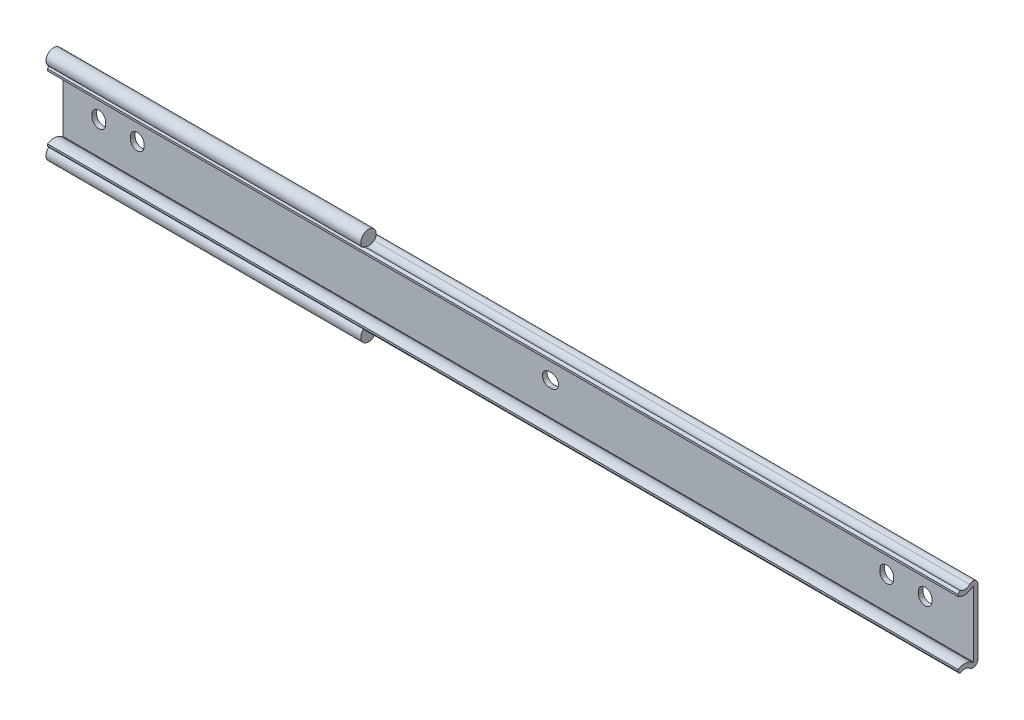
ISO-10303-21;
HEADER;
FILE_DESCRIPTION(('STEP AP214'),'2;1');
FILE_NAME('part.step','',(''),(''),'','','');
FILE_SCHEMA(('AUTOMOTIVE_DESIGN { 1 0 10303 214 1 1 1 1 }'));
ENDSEC;
DATA;
#1=APPLICATION_CONTEXT('core data for automotive mechanical design processes');
#2=APPLICATION_PROTOCOL_DEFINITION('international standard','automotive_design',2000,#1);
#3=PRODUCT_CONTEXT('',#1,'mechanical');
#4=PRODUCT('Part','Part','',(#3));
#5=PRODUCT_RELATED_PRODUCT_CATEGORY('part','',(#4));
#6=PRODUCT_DEFINITION_FORMATION('','',#4);
#7=PRODUCT_DEFINITION_CONTEXT('part definition',#1,'design');
#8=PRODUCT_DEFINITION('design','',#6,#7);
#9=PRODUCT_DEFINITION_SHAPE('','',#8);
#10=(LENGTH_UNIT() NAMED_UNIT(*) SI_UNIT(.MILLI.,.METRE.));
#11=(NAMED_UNIT(*) PLANE_ANGLE_UNIT() SI_UNIT($,.RADIAN.));
#12=(NAMED_UNIT(*) SI_UNIT($,.STERADIAN.) SOLID_ANGLE_UNIT());
#13=UNCERTAINTY_MEASURE_WITH_UNIT(LENGTH_MEASURE(1.E-05),#10,'distance_accuracy_value','');
#14=(GEOMETRIC_REPRESENTATION_CONTEXT(3) GLOBAL_UNCERTAINTY_ASSIGNED_CONTEXT((#13)) GLOBAL_UNIT_ASSIGNED_CONTEXT((#10,
#11,#12)) REPRESENTATION_CONTEXT('',''));
#15=CARTESIAN_POINT('',(0.,0.,0.));
#16=DIRECTION('',(0.,0.,1.));
#17=DIRECTION('',(1.,0.,0.));
#18=AXIS2_PLACEMENT_3D('',#15,#16,#17);
#19=CARTESIAN_POINT('',(-11.9,13.9150000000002,4.44999999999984));
#20=DIRECTION('',(1.,0.,0.));
#21=DIRECTION('',(0.,0.,-1.));
#22=AXIS2_PLACEMENT_3D('',#19,#20,#21);
#23=CYLINDRICAL_SURFACE('',#22,2.55000000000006);
#24=DIRECTION('',(1.,0.,0.));
#25=VECTOR('',#24,1.);
#26=CARTESIAN_POINT('',(-11.9,12.0059666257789,2.75941087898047));
#27=LINE('',#26,#25);
#28=CARTESIAN_POINT('',(92.1,12.0059666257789,2.75941087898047));
#29=VERTEX_POINT('',#28);
#30=CARTESIAN_POINT('',(288.9,12.0059666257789,2.75941087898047));
#31=VERTEX_POINT('',#30);
#32=EDGE_CURVE('E474',#29,#31,#27,.T.);
#33=ORIENTED_EDGE('',*,*,#32,.F.);
#34=CARTESIAN_POINT('',(92.1,13.9150000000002,4.44999999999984));
#35=DIRECTION('',(-1.,0.,0.));
#36=DIRECTION('',(0.,0.,1.));
#37=AXIS2_PLACEMENT_3D('',#34,#35,#36);
#38=CIRCLE('',#37,2.55000000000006);
#39=CARTESIAN_POINT('',(92.1,11.8784795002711,5.98462837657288));
#40=VERTEX_POINT('',#39);
#41=EDGE_CURVE('E287',#29,#40,#38,.T.);
#42=ORIENTED_EDGE('',*,*,#41,.T.);
#43=DIRECTION('',(1.,0.,0.));
#44=VECTOR('',#43,1.);
#45=CARTESIAN_POINT('',(-11.9,11.8784795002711,5.98462837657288));
#46=LINE('',#45,#44);
#47=CARTESIAN_POINT('',(288.9,11.8784795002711,5.98462837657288));
#48=VERTEX_POINT('',#47);
#49=EDGE_CURVE('E473',#40,#48,#46,.T.);
#50=ORIENTED_EDGE('',*,*,#49,.T.);
#51=CARTESIAN_POINT('',(288.9,13.9150000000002,4.44999999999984));
#52=DIRECTION('',(-1.,0.,0.));
#53=DIRECTION('',(0.,0.,1.));
#54=AXIS2_PLACEMENT_3D('',#51,#52,#53);
#55=CIRCLE('',#54,2.55000000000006);
#56=EDGE_CURVE('E401',#31,#48,#55,.T.);
#57=ORIENTED_EDGE('',*,*,#56,.F.);
#58=EDGE_LOOP('',(#33,#42,#50,#57));
#59=FACE_BOUND('',#58,.T.);
#60=ADVANCED_FACE('F16',(#59),#23,.F.);
#61=CARTESIAN_POINT('',(-11.9,-10.7622239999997,0.));
#62=DIRECTION('',(0.,0.,-1.));
#63=DIRECTION('',(-1.,0.,0.));
#64=AXIS2_PLACEMENT_3D('',#61,#62,#63);
#65=PLANE('',#64);
#66=DIRECTION('',(0.,1.,0.));
#67=VECTOR('',#66,1.);
#68=CARTESIAN_POINT('',(-11.9,-10.7622239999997,0.));
#69=LINE('',#68,#67);
#70=CARTESIAN_POINT('',(-11.9,-10.7622239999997,0.));
#71=VERTEX_POINT('',#70);
#72=CARTESIAN_POINT('',(-11.9,10.7622240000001,0.));
#73=VERTEX_POINT('',#72);
#74=EDGE_CURVE('E469',#71,#73,#69,.T.);
#75=ORIENTED_EDGE('',*,*,#74,.T.);
#76=DIRECTION('',(1.,0.,0.));
#77=VECTOR('',#76,1.);
#78=CARTESIAN_POINT('',(-11.9,10.7622240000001,0.));
#79=LINE('',#78,#77);
#80=CARTESIAN_POINT('',(288.9,10.7622240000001,0.));
#81=VERTEX_POINT('',#80);
#82=EDGE_CURVE('E477',#73,#81,#79,.T.);
#83=ORIENTED_EDGE('',*,*,#82,.T.);
#84=DIRECTION('',(0.,1.,0.));
#85=VECTOR('',#84,1.);
#86=CARTESIAN_POINT('',(288.9,-10.7622239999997,0.));
#87=LINE('',#86,#85);
#88=CARTESIAN_POINT('',(288.9,-10.7622239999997,0.));
#89=VERTEX_POINT('',#88);
#90=EDGE_CURVE('E441',#89,#81,#87,.T.);
#91=ORIENTED_EDGE('',*,*,#90,.F.);
#92=DIRECTION('',(1.,0.,0.));
#93=VECTOR('',#92,1.);
#94=CARTESIAN_POINT('',(-11.9,-10.7622239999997,0.));
#95=LINE('',#94,#93);
#96=EDGE_CURVE('E479',#71,#89,#95,.T.);
#97=ORIENTED_EDGE('',*,*,#96,.F.);
#98=EDGE_LOOP('',(#75,#83,#91,#97));
#99=FACE_BOUND('',#98,.T.);
#100=CARTESIAN_POINT('',(149.6,2.32452945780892E-13,0.));
#101=DIRECTION('',(0.,0.,-1.));
#102=DIRECTION('',(-1.,0.,0.));
#103=AXIS2_PLACEMENT_3D('',#100,#101,#102);
#104=CIRCLE('',#103,2.25);
#105=CARTESIAN_POINT('',(149.6,2.25000000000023,0.));
#106=VERTEX_POINT('',#105);
#107=CARTESIAN_POINT('',(149.6,-2.24999999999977,0.));
#108=VERTEX_POINT('',#107);
#109=EDGE_CURVE('E304',#106,#108,#104,.T.);
#110=ORIENTED_EDGE('',*,*,#109,.F.);
#111=DIRECTION('',(1.,0.,0.));
#112=VECTOR('',#111,1.);
#113=CARTESIAN_POINT('',(149.6,2.25000000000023,0.));
#114=LINE('',#113,#112);
#115=CARTESIAN_POINT('',(148.8,2.25000000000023,0.));
#116=VERTEX_POINT('',#115);
#117=EDGE_CURVE('E312',#116,#106,#114,.T.);
#118=ORIENTED_EDGE('',*,*,#117,.F.);
#119=CARTESIAN_POINT('',(148.8,2.32452945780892E-13,0.));
#120=DIRECTION('',(0.,0.,-1.));
#121=DIRECTION('',(-1.,0.,0.));
#122=AXIS2_PLACEMENT_3D('',#119,#120,#121);
#123=CIRCLE('',#122,2.25);
#124=CARTESIAN_POINT('',(148.8,-2.24999999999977,0.));
#125=VERTEX_POINT('',#124);
#126=EDGE_CURVE('E309',#125,#116,#123,.T.);
#127=ORIENTED_EDGE('',*,*,#126,.F.);
#128=DIRECTION('',(-1.,0.,0.));
#129=VECTOR('',#128,1.);
#130=CARTESIAN_POINT('',(149.6,-2.24999999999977,0.));
#131=LINE('',#130,#129);
#132=EDGE_CURVE('E306',#108,#125,#131,.T.);
#133=ORIENTED_EDGE('',*,*,#132,.F.);
#134=EDGE_LOOP('',(#110,#118,#127,#133));
#135=FACE_BOUND('',#134,.T.);
#136=CARTESIAN_POINT('',(0.,-0.400000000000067,0.));
#137=DIRECTION('',(0.,0.,-1.));
#138=DIRECTION('',(1.,0.,0.));
#139=AXIS2_PLACEMENT_3D('',#136,#137,#138);
#140=CIRCLE('',#139,2.24999999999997);
#141=CARTESIAN_POINT('',(2.24999999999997,-0.400000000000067,0.));
#142=VERTEX_POINT('',#141);
#143=CARTESIAN_POINT('',(-2.25000000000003,-0.400000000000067,0.));
#144=VERTEX_POINT('',#143);
#145=EDGE_CURVE('E327',#142,#144,#140,.T.);
#146=ORIENTED_EDGE('',*,*,#145,.F.);
#147=DIRECTION('',(0.,-1.,0.));
#148=VECTOR('',#147,1.);
#149=CARTESIAN_POINT('',(2.24999999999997,-0.400000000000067,0.));
#150=LINE('',#149,#148);
#151=CARTESIAN_POINT('',(2.24999999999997,0.400000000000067,0.));
#152=VERTEX_POINT('',#151);
#153=EDGE_CURVE('E335',#152,#142,#150,.T.);
#154=ORIENTED_EDGE('',*,*,#153,.F.);
#155=CARTESIAN_POINT('',(0.,0.400000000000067,0.));
#156=DIRECTION('',(0.,0.,-1.));
#157=DIRECTION('',(1.,0.,0.));
#158=AXIS2_PLACEMENT_3D('',#155,#156,#157);
#159=CIRCLE('',#158,2.24999999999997);
#160=CARTESIAN_POINT('',(-2.25000000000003,0.400000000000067,0.));
#161=VERTEX_POINT('',#160);
#162=EDGE_CURVE('E332',#161,#152,#159,.T.);
#163=ORIENTED_EDGE('',*,*,#162,.F.);
#164=DIRECTION('',(0.,1.,0.));
#165=VECTOR('',#164,1.);
#166=CARTESIAN_POINT('',(-2.25000000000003,-0.400000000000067,0.));
#167=LINE('',#166,#165);
#168=EDGE_CURVE('E329',#144,#161,#167,.T.);
#169=ORIENTED_EDGE('',*,*,#168,.F.);
#170=EDGE_LOOP('',(#146,#154,#163,#169));
#171=FACE_BOUND('',#170,.T.);
#172=CARTESIAN_POINT('',(12.7,-0.400000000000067,0.));
#173=DIRECTION('',(0.,0.,-1.));
#174=DIRECTION('',(1.,0.,0.));
#175=AXIS2_PLACEMENT_3D('',#172,#173,#174);
#176=CIRCLE('',#175,2.24999999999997);
#177=CARTESIAN_POINT('',(14.95,-0.400000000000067,0.));
#178=VERTEX_POINT('',#177);
#179=CARTESIAN_POINT('',(10.45,-0.400000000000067,0.));
#180=VERTEX_POINT('',#179);
#181=EDGE_CURVE('E341',#178,#180,#176,.T.);
#182=ORIENTED_EDGE('',*,*,#181,.F.);
#183=DIRECTION('',(0.,-1.,0.));
#184=VECTOR('',#183,1.);
#185=CARTESIAN_POINT('',(14.95,-0.400000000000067,0.));
#186=LINE('',#185,#184);
#187=CARTESIAN_POINT('',(14.95,0.400000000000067,0.));
#188=VERTEX_POINT('',#187);
#189=EDGE_CURVE('E355',#188,#178,#186,.T.);
#190=ORIENTED_EDGE('',*,*,#189,.F.);
#191=CARTESIAN_POINT('',(12.7,0.400000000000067,0.));
#192=DIRECTION('',(0.,0.,-1.));
#193=DIRECTION('',(1.,0.,0.));
#194=AXIS2_PLACEMENT_3D('',#191,#192,#193);
#195=CIRCLE('',#194,2.24999999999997);
#196=CARTESIAN_POINT('',(10.45,0.400000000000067,0.));
#197=VERTEX_POINT('',#196);
#198=EDGE_CURVE('E352',#197,#188,#195,.T.);
#199=ORIENTED_EDGE('',*,*,#198,.F.);
#200=DIRECTION('',(0.,1.,0.));
#201=VECTOR('',#200,1.);
#202=CARTESIAN_POINT('',(10.45,-0.400000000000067,0.));
#203=LINE('',#202,#201);
#204=EDGE_CURVE('E349',#180,#197,#203,.T.);
#205=ORIENTED_EDGE('',*,*,#204,.F.);
#206=EDGE_LOOP('',(#182,#190,#199,#205));
#207=FACE_BOUND('',#206,.T.);
#208=CARTESIAN_POINT('',(260.3,-0.400000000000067,0.));
#209=DIRECTION('',(0.,0.,-1.));
#210=DIRECTION('',(1.,0.,0.));
#211=AXIS2_PLACEMENT_3D('',#208,#209,#210);
#212=CIRCLE('',#211,2.24999999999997);
#213=CARTESIAN_POINT('',(262.55,-0.400000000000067,0.));
#214=VERTEX_POINT('',#213);
#215=CARTESIAN_POINT('',(258.05,-0.400000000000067,0.));
#216=VERTEX_POINT('',#215);
#217=EDGE_CURVE('E361',#214,#216,#212,.T.);
#218=ORIENTED_EDGE('',*,*,#217,.F.);
#219=DIRECTION('',(0.,-1.,0.));
#220=VECTOR('',#219,1.);
#221=CARTESIAN_POINT('',(262.55,-0.400000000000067,0.));
#222=LINE('',#221,#220);
#223=CARTESIAN_POINT('',(262.55,0.400000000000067,0.));
#224=VERTEX_POINT('',#223);
#225=EDGE_CURVE('E375',#224,#214,#222,.T.);
#226=ORIENTED_EDGE('',*,*,#225,.F.);
#227=CARTESIAN_POINT('',(260.3,0.400000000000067,0.));
#228=DIRECTION('',(0.,0.,-1.));
#229=DIRECTION('',(1.,0.,0.));
#230=AXIS2_PLACEMENT_3D('',#227,#228,#229);
#231=CIRCLE('',#230,2.24999999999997);
#232=CARTESIAN_POINT('',(258.05,0.400000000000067,0.));
#233=VERTEX_POINT('',#232);
#234=EDGE_CURVE('E372',#233,#224,#231,.T.);
#235=ORIENTED_EDGE('',*,*,#234,.F.);
#236=DIRECTION('',(0.,1.,0.));
#237=VECTOR('',#236,1.);
#238=CARTESIAN_POINT('',(258.05,-0.400000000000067,0.));
#239=LINE('',#238,#237);
#240=EDGE_CURVE('E369',#216,#233,#239,.T.);
#241=ORIENTED_EDGE('',*,*,#240,.F.);
#242=EDGE_LOOP('',(#218,#226,#235,#241));
#243=FACE_BOUND('',#242,.T.);
#244=CARTESIAN_POINT('',(273.,-0.400000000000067,0.));
#245=DIRECTION('',(0.,0.,-1.));
#246=DIRECTION('',(1.,0.,0.));
#247=AXIS2_PLACEMENT_3D('',#244,#245,#246);
#248=CIRCLE('',#247,2.24999999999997);
#249=CARTESIAN_POINT('',(275.25,-0.400000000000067,0.));
#250=VERTEX_POINT('',#249);
#251=CARTESIAN_POINT('',(270.75,-0.400000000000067,0.));
#252=VERTEX_POINT('',#251);
#253=EDGE_CURVE('E381',#250,#252,#248,.T.);
#254=ORIENTED_EDGE('',*,*,#253,.F.);
#255=DIRECTION('',(0.,-1.,0.));
#256=VECTOR('',#255,1.);
#257=CARTESIAN_POINT('',(275.25,-0.400000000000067,0.));
#258=LINE('',#257,#256);
#259=CARTESIAN_POINT('',(275.25,0.400000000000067,0.));
#260=VERTEX_POINT('',#259);
#261=EDGE_CURVE('E395',#260,#250,#258,.T.);
#262=ORIENTED_EDGE('',*,*,#261,.F.);
#263=CARTESIAN_POINT('',(273.,0.400000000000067,0.));
#264=DIRECTION('',(0.,0.,-1.));
#265=DIRECTION('',(1.,0.,0.));
#266=AXIS2_PLACEMENT_3D('',#263,#264,#265);
#267=CIRCLE('',#266,2.24999999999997);
#268=CARTESIAN_POINT('',(270.75,0.400000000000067,0.));
#269=VERTEX_POINT('',#268);
#270=EDGE_CURVE('E392',#269,#260,#267,.T.);
#271=ORIENTED_EDGE('',*,*,#270,.F.);
#272=DIRECTION('',(0.,1.,0.));
#273=VECTOR('',#272,1.);
#274=CARTESIAN_POINT('',(270.75,-0.400000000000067,0.));
#275=LINE('',#274,#273);
#276=EDGE_CURVE('E389',#252,#269,#275,.T.);
#277=ORIENTED_EDGE('',*,*,#276,.F.);
#278=EDGE_LOOP('',(#254,#262,#271,#277));
#279=FACE_BOUND('',#278,.T.);
#280=ADVANCED_FACE('F565',(#99,#135,#171,#207,#243,#279),#65,.T.);
#281=CARTESIAN_POINT('',(-11.9,10.7622240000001,1.54999999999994));
#282=DIRECTION('',(0.,0.,1.));
#283=DIRECTION('',(1.,0.,0.));
#284=AXIS2_PLACEMENT_3D('',#281,#282,#283);
#285=PLANE('',#284);
#286=DIRECTION('',(0.,-1.,0.));
#287=VECTOR('',#286,1.);
#288=CARTESIAN_POINT('',(-11.9,10.7622240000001,1.54999999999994));
#289=LINE('',#288,#287);
#290=CARTESIAN_POINT('',(-11.9,10.7622240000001,1.54999999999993));
#291=VERTEX_POINT('',#290);
#292=CARTESIAN_POINT('',(-11.9,-10.7622239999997,1.54999999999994));
#293=VERTEX_POINT('',#292);
#294=EDGE_CURVE('E454',#291,#293,#289,.T.);
#295=ORIENTED_EDGE('',*,*,#294,.T.);
#296=DIRECTION('',(1.,0.,0.));
#297=VECTOR('',#296,1.);
#298=CARTESIAN_POINT('',(-11.9,-10.7622239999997,1.54999999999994));
#299=LINE('',#298,#297);
#300=CARTESIAN_POINT('',(288.9,-10.7622239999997,1.54999999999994));
#301=VERTEX_POINT('',#300);
#302=EDGE_CURVE('E492',#293,#301,#299,.T.);
#303=ORIENTED_EDGE('',*,*,#302,.T.);
#304=DIRECTION('',(0.,-1.,0.));
#305=VECTOR('',#304,1.);
#306=CARTESIAN_POINT('',(288.9,10.7622240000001,1.54999999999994));
#307=LINE('',#306,#305);
#308=CARTESIAN_POINT('',(288.9,10.7622240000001,1.54999999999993));
#309=VERTEX_POINT('',#308);
#310=EDGE_CURVE('E422',#309,#301,#307,.T.);
#311=ORIENTED_EDGE('',*,*,#310,.F.);
#312=DIRECTION('',(1.,0.,0.));
#313=VECTOR('',#312,1.);
#314=CARTESIAN_POINT('',(-11.9,10.7622240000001,1.54999999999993));
#315=LINE('',#314,#313);
#316=EDGE_CURVE('E494',#291,#309,#315,.T.);
#317=ORIENTED_EDGE('',*,*,#316,.F.);
#318=EDGE_LOOP('',(#295,#303,#311,#317));
#319=FACE_BOUND('',#318,.T.);
#320=CARTESIAN_POINT('',(149.6,2.32452945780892E-13,1.54999999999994));
#321=DIRECTION('',(0.,0.,1.));
#322=DIRECTION('',(1.,0.,0.));
#323=AXIS2_PLACEMENT_3D('',#320,#321,#322);
#324=CIRCLE('',#323,2.25);
#325=CARTESIAN_POINT('',(149.6,2.25000000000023,1.54999999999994));
#326=VERTEX_POINT('',#325);
#327=CARTESIAN_POINT('',(149.6,-2.24999999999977,1.54999999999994));
#328=VERTEX_POINT('',#327);
#329=EDGE_CURVE('E301',#326,#328,#324,.F.);
#330=ORIENTED_EDGE('',*,*,#329,.T.);
#331=DIRECTION('',(-1.,0.,0.));
#332=VECTOR('',#331,1.);
#333=CARTESIAN_POINT('',(149.6,-2.24999999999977,1.54999999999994));
#334=LINE('',#333,#332);
#335=CARTESIAN_POINT('',(148.8,-2.24999999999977,1.54999999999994));
#336=VERTEX_POINT('',#335);
#337=EDGE_CURVE('E318',#328,#336,#334,.T.);
#338=ORIENTED_EDGE('',*,*,#337,.T.);
#339=CARTESIAN_POINT('',(148.8,2.32452945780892E-13,1.54999999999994));
#340=DIRECTION('',(0.,0.,1.));
#341=DIRECTION('',(1.,0.,0.));
#342=AXIS2_PLACEMENT_3D('',#339,#340,#341);
#343=CIRCLE('',#342,2.25);
#344=CARTESIAN_POINT('',(148.8,2.25000000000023,1.54999999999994));
#345=VERTEX_POINT('',#344);
#346=EDGE_CURVE('E295',#336,#345,#343,.F.);
#347=ORIENTED_EDGE('',*,*,#346,.T.);
#348=DIRECTION('',(1.,0.,0.));
#349=VECTOR('',#348,1.);
#350=CARTESIAN_POINT('',(149.6,2.25000000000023,1.54999999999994));
#351=LINE('',#350,#349);
#352=EDGE_CURVE('E298',#345,#326,#351,.T.);
#353=ORIENTED_EDGE('',*,*,#352,.T.);
#354=EDGE_LOOP('',(#330,#338,#347,#353));
#355=FACE_BOUND('',#354,.T.);
#356=CARTESIAN_POINT('',(0.,-0.400000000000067,1.54999999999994));
#357=DIRECTION('',(0.,0.,1.));
#358=DIRECTION('',(1.,0.,0.));
#359=AXIS2_PLACEMENT_3D('',#356,#357,#358);
#360=CIRCLE('',#359,2.24999999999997);
#361=CARTESIAN_POINT('',(-2.25000000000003,-0.400000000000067,1.54999999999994));
#362=VERTEX_POINT('',#361);
#363=CARTESIAN_POINT('',(2.24999999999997,-0.400000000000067,1.54999999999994));
#364=VERTEX_POINT('',#363);
#365=EDGE_CURVE('E536',#362,#364,#360,.T.);
#366=ORIENTED_EDGE('',*,*,#365,.F.);
#367=DIRECTION('',(0.,-1.,0.));
#368=VECTOR('',#367,1.);
#369=CARTESIAN_POINT('',(-2.25000000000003,10.7622240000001,1.54999999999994));
#370=LINE('',#369,#368);
#371=CARTESIAN_POINT('',(-2.25000000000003,0.400000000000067,1.54999999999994));
#372=VERTEX_POINT('',#371);
#373=EDGE_CURVE('E529',#372,#362,#370,.T.);
#374=ORIENTED_EDGE('',*,*,#373,.F.);
#375=CARTESIAN_POINT('',(0.,0.400000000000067,1.54999999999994));
#376=DIRECTION('',(0.,0.,1.));
#377=DIRECTION('',(1.,0.,0.));
#378=AXIS2_PLACEMENT_3D('',#375,#376,#377);
#379=CIRCLE('',#378,2.24999999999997);
#380=CARTESIAN_POINT('',(2.24999999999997,0.400000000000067,1.54999999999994));
#381=VERTEX_POINT('',#380);
#382=EDGE_CURVE('E531',#381,#372,#379,.T.);
#383=ORIENTED_EDGE('',*,*,#382,.F.);
#384=DIRECTION('',(0.,1.,0.));
#385=VECTOR('',#384,1.);
#386=CARTESIAN_POINT('',(2.24999999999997,10.7622240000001,1.54999999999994));
#387=LINE('',#386,#385);
#388=EDGE_CURVE('E534',#364,#381,#387,.T.);
#389=ORIENTED_EDGE('',*,*,#388,.F.);
#390=EDGE_LOOP('',(#366,#374,#383,#389));
#391=FACE_BOUND('',#390,.T.);
#392=CARTESIAN_POINT('',(12.7,-0.400000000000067,1.54999999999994));
#393=DIRECTION('',(0.,0.,1.));
#394=DIRECTION('',(1.,0.,0.));
#395=AXIS2_PLACEMENT_3D('',#392,#393,#394);
#396=CIRCLE('',#395,2.24999999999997);
#397=CARTESIAN_POINT('',(10.45,-0.400000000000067,1.54999999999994));
#398=VERTEX_POINT('',#397);
#399=CARTESIAN_POINT('',(14.95,-0.400000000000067,1.54999999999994));
#400=VERTEX_POINT('',#399);
#401=EDGE_CURVE('E527',#398,#400,#396,.T.);
#402=ORIENTED_EDGE('',*,*,#401,.F.);
#403=DIRECTION('',(0.,-1.,0.));
#404=VECTOR('',#403,1.);
#405=CARTESIAN_POINT('',(10.45,10.7622240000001,1.54999999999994));
#406=LINE('',#405,#404);
#407=CARTESIAN_POINT('',(10.45,0.400000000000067,1.54999999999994));
#408=VERTEX_POINT('',#407);
#409=EDGE_CURVE('E520',#408,#398,#406,.T.);
#410=ORIENTED_EDGE('',*,*,#409,.F.);
#411=CARTESIAN_POINT('',(12.7,0.400000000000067,1.54999999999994));
#412=DIRECTION('',(0.,0.,1.));
#413=DIRECTION('',(1.,0.,0.));
#414=AXIS2_PLACEMENT_3D('',#411,#412,#413);
#415=CIRCLE('',#414,2.24999999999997);
#416=CARTESIAN_POINT('',(14.95,0.400000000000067,1.54999999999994));
#417=VERTEX_POINT('',#416);
#418=EDGE_CURVE('E522',#417,#408,#415,.T.);
#419=ORIENTED_EDGE('',*,*,#418,.F.);
#420=DIRECTION('',(0.,1.,0.));
#421=VECTOR('',#420,1.);
#422=CARTESIAN_POINT('',(14.95,10.7622240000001,1.54999999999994));
#423=LINE('',#422,#421);
#424=EDGE_CURVE('E525',#400,#417,#423,.T.);
#425=ORIENTED_EDGE('',*,*,#424,.F.);
#426=EDGE_LOOP('',(#402,#410,#419,#425));
#427=FACE_BOUND('',#426,.T.);
#428=CARTESIAN_POINT('',(260.3,-0.400000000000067,1.54999999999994));
#429=DIRECTION('',(0.,0.,1.));
#430=DIRECTION('',(1.,0.,0.));
#431=AXIS2_PLACEMENT_3D('',#428,#429,#430);
#432=CIRCLE('',#431,2.24999999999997);
#433=CARTESIAN_POINT('',(258.05,-0.400000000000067,1.54999999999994));
#434=VERTEX_POINT('',#433);
#435=CARTESIAN_POINT('',(262.55,-0.400000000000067,1.54999999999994));
#436=VERTEX_POINT('',#435);
#437=EDGE_CURVE('E518',#434,#436,#432,.T.);
#438=ORIENTED_EDGE('',*,*,#437,.F.);
#439=DIRECTION('',(0.,-1.,0.));
#440=VECTOR('',#439,1.);
#441=CARTESIAN_POINT('',(258.05,10.7622240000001,1.54999999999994));
#442=LINE('',#441,#440);
#443=CARTESIAN_POINT('',(258.05,0.400000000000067,1.54999999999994));
#444=VERTEX_POINT('',#443);
#445=EDGE_CURVE('E511',#444,#434,#442,.T.);
#446=ORIENTED_EDGE('',*,*,#445,.F.);
#447=CARTESIAN_POINT('',(260.3,0.400000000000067,1.54999999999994));
#448=DIRECTION('',(0.,0.,1.));
#449=DIRECTION('',(1.,0.,0.));
#450=AXIS2_PLACEMENT_3D('',#447,#448,#449);
#451=CIRCLE('',#450,2.24999999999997);
#452=CARTESIAN_POINT('',(262.55,0.400000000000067,1.54999999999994));
#453=VERTEX_POINT('',#452);
#454=EDGE_CURVE('E513',#453,#444,#451,.T.);
#455=ORIENTED_EDGE('',*,*,#454,.F.);
#456=DIRECTION('',(0.,1.,0.));
#457=VECTOR('',#456,1.);
#458=CARTESIAN_POINT('',(262.55,10.7622240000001,1.54999999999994));
#459=LINE('',#458,#457);
#460=EDGE_CURVE('E516',#436,#453,#459,.T.);
#461=ORIENTED_EDGE('',*,*,#460,.F.);
#462=EDGE_LOOP('',(#438,#446,#455,#461));
#463=FACE_BOUND('',#462,.T.);
#464=CARTESIAN_POINT('',(273.,-0.400000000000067,1.54999999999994));
#465=DIRECTION('',(0.,0.,1.));
#466=DIRECTION('',(1.,0.,0.));
#467=AXIS2_PLACEMENT_3D('',#464,#465,#466);
#468=CIRCLE('',#467,2.24999999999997);
#469=CARTESIAN_POINT('',(270.75,-0.400000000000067,1.54999999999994));
#470=VERTEX_POINT('',#469);
#471=CARTESIAN_POINT('',(275.25,-0.400000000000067,1.54999999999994));
#472=VERTEX_POINT('',#471);
#473=EDGE_CURVE('E509',#470,#472,#468,.T.);
#474=ORIENTED_EDGE('',*,*,#473,.F.);
#475=DIRECTION('',(0.,-1.,0.));
#476=VECTOR('',#475,1.);
#477=CARTESIAN_POINT('',(270.75,10.7622240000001,1.54999999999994));
#478=LINE('',#477,#476);
#479=CARTESIAN_POINT('',(270.75,0.400000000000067,1.54999999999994));
#480=VERTEX_POINT('',#479);
#481=EDGE_CURVE('E476',#480,#470,#478,.T.);
#482=ORIENTED_EDGE('',*,*,#481,.F.);
#483=CARTESIAN_POINT('',(273.,0.400000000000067,1.54999999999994));
#484=DIRECTION('',(0.,0.,1.));
#485=DIRECTION('',(1.,0.,0.));
#486=AXIS2_PLACEMENT_3D('',#483,#484,#485);
#487=CIRCLE('',#486,2.24999999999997);
#488=CARTESIAN_POINT('',(275.25,0.400000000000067,1.54999999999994));
#489=VERTEX_POINT('',#488);
#490=EDGE_CURVE('E504',#489,#480,#487,.T.);
#491=ORIENTED_EDGE('',*,*,#490,.F.);
#492=DIRECTION('',(0.,1.,0.));
#493=VECTOR('',#492,1.);
#494=CARTESIAN_POINT('',(275.25,10.7622240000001,1.54999999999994));
#495=LINE('',#494,#493);
#496=EDGE_CURVE('E507',#472,#489,#495,.T.);
#497=ORIENTED_EDGE('',*,*,#496,.F.);
#498=EDGE_LOOP('',(#474,#482,#491,#497));
#499=FACE_BOUND('',#498,.T.);
#500=ADVANCED_FACE('F596',(#319,#355,#391,#427,#463,#499),#285,.T.);
#501=CARTESIAN_POINT('',(-11.9,13.9150000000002,4.44999999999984));
#502=DIRECTION('',(-1.,0.,0.));
#503=DIRECTION('',(0.,0.,1.));
#504=AXIS2_PLACEMENT_3D('',#501,#502,#503);
#505=PLANE('',#504);
#506=CARTESIAN_POINT('',(-11.9,-10.7622239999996,1.66));
#507=DIRECTION('',(1.,0.,0.));
#508=DIRECTION('',(0.,0.,1.));
#509=AXIS2_PLACEMENT_3D('',#506,#507,#508);
#510=CIRCLE('',#509,1.66);
#511=CARTESIAN_POINT('',(-11.9,-12.2669175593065,2.36106867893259));
#512=VERTEX_POINT('',#511);
#513=EDGE_CURVE('E467',#512,#71,#510,.T.);
#514=ORIENTED_EDGE('',*,*,#513,.F.);
#515=CARTESIAN_POINT('',(-11.9,-13.5749999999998,4.55));
#516=DIRECTION('',(-1.,0.,0.));
#517=DIRECTION('',(0.,0.,-1.));
#518=AXIS2_PLACEMENT_3D('',#515,#516,#517);
#519=CIRCLE('',#518,2.55);
#520=CARTESIAN_POINT('',(-11.9,-11.6159967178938,6.18242339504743));
#521=VERTEX_POINT('',#520);
#522=EDGE_CURVE('E552',#512,#521,#519,.T.);
#523=ORIENTED_EDGE('',*,*,#522,.T.);
#524=DIRECTION('',(0.,-0.798635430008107,-0.60181512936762));
#525=VECTOR('',#524,1.);
#526=CARTESIAN_POINT('',(-11.9,-11.8784795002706,5.98462837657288));
#527=LINE('',#526,#525);
#528=CARTESIAN_POINT('',(-11.9,-11.0618539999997,6.6));
#529=VERTEX_POINT('',#528);
#530=EDGE_CURVE('E465',#529,#521,#527,.T.);
#531=ORIENTED_EDGE('',*,*,#530,.F.);
#532=DIRECTION('',(0.,-1.,0.));
#533=VECTOR('',#532,1.);
#534=CARTESIAN_POINT('',(-11.9,-11.0618539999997,6.6));
#535=LINE('',#534,#533);
#536=CARTESIAN_POINT('',(-11.9,-10.4239399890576,6.59999999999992));
#537=VERTEX_POINT('',#536);
#538=EDGE_CURVE('E462',#537,#529,#535,.T.);
#539=ORIENTED_EDGE('',*,*,#538,.F.);
#540=CARTESIAN_POINT('',(-11.9,-13.9149999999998,4.44999999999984));
#541=DIRECTION('',(1.,0.,0.));
#542=DIRECTION('',(0.,0.,1.));
#543=AXIS2_PLACEMENT_3D('',#540,#541,#542);
#544=CIRCLE('',#543,4.1);
#545=CARTESIAN_POINT('',(-11.9,-10.8444026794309,1.73312089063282));
#546=VERTEX_POINT('',#545);
#547=EDGE_CURVE('E459',#546,#537,#544,.T.);
#548=ORIENTED_EDGE('',*,*,#547,.F.);
#549=CARTESIAN_POINT('',(-11.9,-10.7622239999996,1.66));
#550=DIRECTION('',(-1.,0.,0.));
#551=DIRECTION('',(0.,0.,-1.));
#552=AXIS2_PLACEMENT_3D('',#549,#550,#551);
#553=CIRCLE('',#552,0.110000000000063);
#554=EDGE_CURVE('E456',#293,#546,#553,.T.);
#555=ORIENTED_EDGE('',*,*,#554,.F.);
#556=ORIENTED_EDGE('',*,*,#294,.F.);
#557=CARTESIAN_POINT('',(-11.9,10.762224,1.66));
#558=DIRECTION('',(-1.,0.,0.));
#559=DIRECTION('',(0.,0.,1.));
#560=AXIS2_PLACEMENT_3D('',#557,#558,#559);
#561=CIRCLE('',#560,0.110000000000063);
#562=CARTESIAN_POINT('',(-11.9,10.8444026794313,1.73312089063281));
#563=VERTEX_POINT('',#562);
#564=EDGE_CURVE('E451',#563,#291,#561,.T.);
#565=ORIENTED_EDGE('',*,*,#564,.F.);
#566=CARTESIAN_POINT('',(-11.9,13.9150000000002,4.44999999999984));
#567=DIRECTION('',(1.,0.,0.));
#568=DIRECTION('',(0.,0.,-1.));
#569=AXIS2_PLACEMENT_3D('',#566,#567,#568);
#570=CIRCLE('',#569,4.1);
#571=CARTESIAN_POINT('',(-11.9,10.423939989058,6.6));
#572=VERTEX_POINT('',#571);
#573=EDGE_CURVE('E448',#572,#563,#570,.T.);
#574=ORIENTED_EDGE('',*,*,#573,.F.);
#575=DIRECTION('',(0.,-1.,0.));
#576=VECTOR('',#575,1.);
#577=CARTESIAN_POINT('',(-11.9,11.0618540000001,6.6));
#578=LINE('',#577,#576);
#579=CARTESIAN_POINT('',(-11.9,11.0618540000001,6.6));
#580=VERTEX_POINT('',#579);
#581=EDGE_CURVE('E267',#580,#572,#578,.T.);
#582=ORIENTED_EDGE('',*,*,#581,.F.);
#583=DIRECTION('',(0.,-0.798635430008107,0.60181512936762));
#584=VECTOR('',#583,1.);
#585=CARTESIAN_POINT('',(-11.9,11.8784795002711,5.98462837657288));
#586=LINE('',#585,#584);
#587=CARTESIAN_POINT('',(-11.9,11.6159967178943,6.18242339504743));
#588=VERTEX_POINT('',#587);
#589=EDGE_CURVE('E259',#588,#580,#586,.T.);
#590=ORIENTED_EDGE('',*,*,#589,.F.);
#591=CARTESIAN_POINT('',(-11.9,13.5750000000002,4.55));
#592=DIRECTION('',(-1.,0.,0.));
#593=DIRECTION('',(0.,0.,1.));
#594=AXIS2_PLACEMENT_3D('',#591,#592,#593);
#595=CIRCLE('',#594,2.55);
#596=CARTESIAN_POINT('',(-11.9,12.266917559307,2.36106867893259));
#597=VERTEX_POINT('',#596);
#598=EDGE_CURVE('E264',#588,#597,#595,.T.);
#599=ORIENTED_EDGE('',*,*,#598,.T.);
#600=CARTESIAN_POINT('',(-11.9,10.762224,1.66));
#601=DIRECTION('',(1.,0.,0.));
#602=DIRECTION('',(0.,0.,-1.));
#603=AXIS2_PLACEMENT_3D('',#600,#601,#602);
#604=CIRCLE('',#603,1.66);
#605=EDGE_CURVE('E471',#73,#597,#604,.T.);
#606=ORIENTED_EDGE('',*,*,#605,.F.);
#607=ORIENTED_EDGE('',*,*,#74,.F.);
#608=EDGE_LOOP('',(#514,#523,#531,#539,#548,#555,#556,#565,#574,#582,#590,#599,#606,#607));
#609=FACE_BOUND('',#608,.T.);
#610=ADVANCED_FACE('F261',(#609),#505,.T.);
#611=CARTESIAN_POINT('',(-11.9,10.762224,1.66));
#612=DIRECTION('',(1.,0.,0.));
#613=DIRECTION('',(0.,0.,-1.));
#614=AXIS2_PLACEMENT_3D('',#611,#612,#613);
#615=CYLINDRICAL_SURFACE('',#614,1.66);
#616=DIRECTION('',(-1.,0.,0.));
#617=VECTOR('',#616,1.);
#618=CARTESIAN_POINT('',(40.1,12.266917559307,2.36106867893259));
#619=LINE('',#618,#617);
#620=CARTESIAN_POINT('',(92.1,12.266917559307,2.36106867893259));
#621=VERTEX_POINT('',#620);
#622=EDGE_CURVE('E284',#621,#597,#619,.T.);
#623=ORIENTED_EDGE('',*,*,#622,.F.);
#624=CARTESIAN_POINT('',(92.1,10.762224,1.66));
#625=DIRECTION('',(-1.,0.,0.));
#626=DIRECTION('',(0.,0.,1.));
#627=AXIS2_PLACEMENT_3D('',#624,#625,#626);
#628=CIRCLE('',#627,1.66);
#629=EDGE_CURVE('E292',#621,#29,#628,.F.);
#630=ORIENTED_EDGE('',*,*,#629,.T.);
#631=ORIENTED_EDGE('',*,*,#32,.T.);
#632=CARTESIAN_POINT('',(288.9,10.762224,1.66));
#633=DIRECTION('',(1.,0.,0.));
#634=DIRECTION('',(0.,0.,-1.));
#635=AXIS2_PLACEMENT_3D('',#632,#633,#634);
#636=CIRCLE('',#635,1.66);
#637=EDGE_CURVE('E270',#81,#31,#636,.T.);
#638=ORIENTED_EDGE('',*,*,#637,.F.);
#639=ORIENTED_EDGE('',*,*,#82,.F.);
#640=ORIENTED_EDGE('',*,*,#605,.T.);
#641=EDGE_LOOP('',(#623,#630,#631,#638,#639,#640));
#642=FACE_BOUND('',#641,.T.);
#643=ADVANCED_FACE('F573',(#642),#615,.T.);
#644=CARTESIAN_POINT('',(-11.9,-10.7622239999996,1.66));
#645=DIRECTION('',(1.,0.,0.));
#646=DIRECTION('',(0.,0.,-1.));
#647=AXIS2_PLACEMENT_3D('',#644,#645,#646);
#648=CYLINDRICAL_SURFACE('',#647,1.66);
#649=DIRECTION('',(-1.,0.,0.));
#650=VECTOR('',#649,1.);
#651=CARTESIAN_POINT('',(40.1,-12.2669175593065,2.36106867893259));
#652=LINE('',#651,#650);
#653=CARTESIAN_POINT('',(92.1,-12.2669175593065,2.36106867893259));
#654=VERTEX_POINT('',#653);
#655=EDGE_CURVE('E34',#512,#654,#652,.F.);
#656=ORIENTED_EDGE('',*,*,#655,.F.);
#657=ORIENTED_EDGE('',*,*,#513,.T.);
#658=ORIENTED_EDGE('',*,*,#96,.T.);
#659=CARTESIAN_POINT('',(288.9,-10.7622239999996,1.66));
#660=DIRECTION('',(1.,0.,0.));
#661=DIRECTION('',(0.,0.,1.));
#662=AXIS2_PLACEMENT_3D('',#659,#660,#661);
#663=CIRCLE('',#662,1.66);
#664=CARTESIAN_POINT('',(288.9,-12.0059666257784,2.75941087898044));
#665=VERTEX_POINT('',#664);
#666=EDGE_CURVE('E440',#665,#89,#663,.T.);
#667=ORIENTED_EDGE('',*,*,#666,.F.);
#668=DIRECTION('',(1.,0.,0.));
#669=VECTOR('',#668,1.);
#670=CARTESIAN_POINT('',(-11.9,-12.0059666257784,2.75941087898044));
#671=LINE('',#670,#669);
#672=CARTESIAN_POINT('',(92.1,-12.0059666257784,2.75941087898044));
#673=VERTEX_POINT('',#672);
#674=EDGE_CURVE('E482',#673,#665,#671,.T.);
#675=ORIENTED_EDGE('',*,*,#674,.F.);
#676=CARTESIAN_POINT('',(92.1,-10.7622239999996,1.66));
#677=DIRECTION('',(1.,0.,0.));
#678=DIRECTION('',(0.,0.,-1.));
#679=AXIS2_PLACEMENT_3D('',#676,#677,#678);
#680=CIRCLE('',#679,1.66);
#681=EDGE_CURVE('E30',#654,#673,#680,.F.);
#682=ORIENTED_EDGE('',*,*,#681,.F.);
#683=EDGE_LOOP('',(#656,#657,#658,#667,#675,#682));
#684=FACE_BOUND('',#683,.T.);
#685=ADVANCED_FACE('F561',(#684),#648,.T.);
#686=CARTESIAN_POINT('',(-11.9,-13.9149999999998,4.44999999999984));
#687=DIRECTION('',(1.,0.,0.));
#688=DIRECTION('',(0.,0.,-1.));
#689=AXIS2_PLACEMENT_3D('',#686,#687,#688);
#690=CYLINDRICAL_SURFACE('',#689,2.55000000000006);
#691=CARTESIAN_POINT('',(92.1,-13.9149999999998,4.44999999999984));
#692=DIRECTION('',(1.,0.,0.));
#693=DIRECTION('',(0.,0.,-1.));
#694=AXIS2_PLACEMENT_3D('',#691,#692,#693);
#695=CIRCLE('',#694,2.55000000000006);
#696=CARTESIAN_POINT('',(92.1,-11.8784795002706,5.98462837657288));
#697=VERTEX_POINT('',#696);
#698=EDGE_CURVE('E545',#673,#697,#695,.T.);
#699=ORIENTED_EDGE('',*,*,#698,.F.);
#700=ORIENTED_EDGE('',*,*,#674,.T.);
#701=CARTESIAN_POINT('',(288.9,-13.9149999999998,4.44999999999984));
#702=DIRECTION('',(-1.,0.,0.));
#703=DIRECTION('',(0.,0.,-1.));
#704=AXIS2_PLACEMENT_3D('',#701,#702,#703);
#705=CIRCLE('',#704,2.55000000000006);
#706=CARTESIAN_POINT('',(288.9,-11.8784795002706,5.98462837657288));
#707=VERTEX_POINT('',#706);
#708=EDGE_CURVE('E437',#707,#665,#705,.T.);
#709=ORIENTED_EDGE('',*,*,#708,.F.);
#710=DIRECTION('',(1.,0.,0.));
#711=VECTOR('',#710,1.);
#712=CARTESIAN_POINT('',(-11.9,-11.8784795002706,5.98462837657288));
#713=LINE('',#712,#711);
#714=EDGE_CURVE('E484',#697,#707,#713,.T.);
#715=ORIENTED_EDGE('',*,*,#714,.F.);
#716=EDGE_LOOP('',(#699,#700,#709,#715));
#717=FACE_BOUND('',#716,.T.);
#718=ADVANCED_FACE('F609',(#717),#690,.F.);
#719=CARTESIAN_POINT('',(-11.9,-11.8784795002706,5.98462837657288));
#720=DIRECTION('',(0.,-0.60181512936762,0.798635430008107));
#721=DIRECTION('',(0.,-0.798635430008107,-0.60181512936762));
#722=AXIS2_PLACEMENT_3D('',#719,#720,#721);
#723=PLANE('',#722);
#724=DIRECTION('',(-1.,0.,0.));
#725=VECTOR('',#724,1.);
#726=CARTESIAN_POINT('',(92.1,-11.6159967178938,6.18242339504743));
#727=LINE('',#726,#725);
#728=CARTESIAN_POINT('',(92.1,-11.6159967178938,6.18242339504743));
#729=VERTEX_POINT('',#728);
#730=EDGE_CURVE('E10',#729,#521,#727,.T.);
#731=ORIENTED_EDGE('',*,*,#730,.F.);
#732=DIRECTION('',(0.,0.798635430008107,0.60181512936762));
#733=VECTOR('',#732,1.);
#734=CARTESIAN_POINT('',(92.1,-11.8784795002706,5.98462837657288));
#735=LINE('',#734,#733);
#736=EDGE_CURVE('E23',#697,#729,#735,.T.);
#737=ORIENTED_EDGE('',*,*,#736,.F.);
#738=ORIENTED_EDGE('',*,*,#714,.T.);
#739=DIRECTION('',(0.,-0.798635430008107,-0.60181512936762));
#740=VECTOR('',#739,1.);
#741=CARTESIAN_POINT('',(288.9,-11.8784795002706,5.98462837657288));
#742=LINE('',#741,#740);
#743=CARTESIAN_POINT('',(288.9,-11.0618539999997,6.6));
#744=VERTEX_POINT('',#743);
#745=EDGE_CURVE('E434',#744,#707,#742,.T.);
#746=ORIENTED_EDGE('',*,*,#745,.F.);
#747=DIRECTION('',(1.,0.,0.));
#748=VECTOR('',#747,1.);
#749=CARTESIAN_POINT('',(-11.9,-11.0618539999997,6.6));
#750=LINE('',#749,#748);
#751=EDGE_CURVE('E486',#529,#744,#750,.T.);
#752=ORIENTED_EDGE('',*,*,#751,.F.);
#753=ORIENTED_EDGE('',*,*,#530,.T.);
#754=EDGE_LOOP('',(#731,#737,#738,#746,#752,#753));
#755=FACE_BOUND('',#754,.T.);
#756=ADVANCED_FACE('F612',(#755),#723,.T.);
#757=CARTESIAN_POINT('',(-11.9,-11.0618539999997,6.6));
#758=DIRECTION('',(0.,0.,1.));
#759=DIRECTION('',(1.,0.,0.));
#760=AXIS2_PLACEMENT_3D('',#757,#758,#759);
#761=PLANE('',#760);
#762=DIRECTION('',(0.,-1.,0.));
#763=VECTOR('',#762,1.);
#764=CARTESIAN_POINT('',(288.9,-11.0618539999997,6.6));
#765=LINE('',#764,#763);
#766=CARTESIAN_POINT('',(288.9,-10.4239399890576,6.59999999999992));
#767=VERTEX_POINT('',#766);
#768=EDGE_CURVE('E431',#767,#744,#765,.T.);
#769=ORIENTED_EDGE('',*,*,#768,.F.);
#770=DIRECTION('',(1.,0.,0.));
#771=VECTOR('',#770,1.);
#772=CARTESIAN_POINT('',(-11.9,-10.4239399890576,6.59999999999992));
#773=LINE('',#772,#771);
#774=EDGE_CURVE('E488',#537,#767,#773,.T.);
#775=ORIENTED_EDGE('',*,*,#774,.F.);
#776=ORIENTED_EDGE('',*,*,#538,.T.);
#777=ORIENTED_EDGE('',*,*,#751,.T.);
#778=EDGE_LOOP('',(#769,#775,#776,#777));
#779=FACE_BOUND('',#778,.T.);
#780=ADVANCED_FACE('F616',(#779),#761,.T.);
#781=CARTESIAN_POINT('',(-11.9,-13.9149999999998,4.44999999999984));
#782=DIRECTION('',(1.,0.,0.));
#783=DIRECTION('',(0.,0.,-1.));
#784=AXIS2_PLACEMENT_3D('',#781,#782,#783);
#785=CYLINDRICAL_SURFACE('',#784,4.1);
#786=CARTESIAN_POINT('',(288.9,-13.9149999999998,4.44999999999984));
#787=DIRECTION('',(1.,0.,0.));
#788=DIRECTION('',(0.,0.,1.));
#789=AXIS2_PLACEMENT_3D('',#786,#787,#788);
#790=CIRCLE('',#789,4.1);
#791=CARTESIAN_POINT('',(288.9,-10.8444026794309,1.73312089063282));
#792=VERTEX_POINT('',#791);
#793=EDGE_CURVE('E428',#792,#767,#790,.T.);
#794=ORIENTED_EDGE('',*,*,#793,.F.);
#795=DIRECTION('',(1.,0.,0.));
#796=VECTOR('',#795,1.);
#797=CARTESIAN_POINT('',(-11.9,-10.8444026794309,1.73312089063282));
#798=LINE('',#797,#796);
#799=EDGE_CURVE('E490',#546,#792,#798,.T.);
#800=ORIENTED_EDGE('',*,*,#799,.F.);
#801=ORIENTED_EDGE('',*,*,#547,.T.);
#802=ORIENTED_EDGE('',*,*,#774,.T.);
#803=EDGE_LOOP('',(#794,#800,#801,#802));
#804=FACE_BOUND('',#803,.T.);
#805=ADVANCED_FACE('F619',(#804),#785,.T.);
#806=CARTESIAN_POINT('',(-11.9,-10.7622239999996,1.66));
#807=DIRECTION('',(1.,0.,0.));
#808=DIRECTION('',(0.,0.,-1.));
#809=AXIS2_PLACEMENT_3D('',#806,#807,#808);
#810=CYLINDRICAL_SURFACE('',#809,0.110000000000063);
#811=CARTESIAN_POINT('',(288.9,-10.7622239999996,1.66));
#812=DIRECTION('',(-1.,0.,0.));
#813=DIRECTION('',(0.,0.,-1.));
#814=AXIS2_PLACEMENT_3D('',#811,#812,#813);
#815=CIRCLE('',#814,0.110000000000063);
#816=EDGE_CURVE('E425',#301,#792,#815,.T.);
#817=ORIENTED_EDGE('',*,*,#816,.F.);
#818=ORIENTED_EDGE('',*,*,#302,.F.);
#819=ORIENTED_EDGE('',*,*,#554,.T.);
#820=ORIENTED_EDGE('',*,*,#799,.T.);
#821=EDGE_LOOP('',(#817,#818,#819,#820));
#822=FACE_BOUND('',#821,.T.);
#823=ADVANCED_FACE('F623',(#822),#810,.F.);
#824=CARTESIAN_POINT('',(-11.9,10.762224,1.66));
#825=DIRECTION('',(1.,0.,0.));
#826=DIRECTION('',(0.,0.,-1.));
#827=AXIS2_PLACEMENT_3D('',#824,#825,#826);
#828=CYLINDRICAL_SURFACE('',#827,0.110000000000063);
#829=CARTESIAN_POINT('',(288.9,10.762224,1.66));
#830=DIRECTION('',(-1.,0.,0.));
#831=DIRECTION('',(0.,0.,1.));
#832=AXIS2_PLACEMENT_3D('',#829,#830,#831);
#833=CIRCLE('',#832,0.110000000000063);
#834=CARTESIAN_POINT('',(288.9,10.8444026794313,1.73312089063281));
#835=VERTEX_POINT('',#834);
#836=EDGE_CURVE('E419',#835,#309,#833,.T.);
#837=ORIENTED_EDGE('',*,*,#836,.F.);
#838=DIRECTION('',(1.,0.,0.));
#839=VECTOR('',#838,1.);
#840=CARTESIAN_POINT('',(-11.9,10.8444026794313,1.73312089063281));
#841=LINE('',#840,#839);
#842=EDGE_CURVE('E496',#563,#835,#841,.T.);
#843=ORIENTED_EDGE('',*,*,#842,.F.);
#844=ORIENTED_EDGE('',*,*,#564,.T.);
#845=ORIENTED_EDGE('',*,*,#316,.T.);
#846=EDGE_LOOP('',(#837,#843,#844,#845));
#847=FACE_BOUND('',#846,.T.);
#848=ADVANCED_FACE('F626',(#847),#828,.F.);
#849=CARTESIAN_POINT('',(-11.9,13.9150000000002,4.44999999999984));
#850=DIRECTION('',(1.,0.,0.));
#851=DIRECTION('',(0.,0.,-1.));
#852=AXIS2_PLACEMENT_3D('',#849,#850,#851);
#853=CYLINDRICAL_SURFACE('',#852,4.1);
#854=CARTESIAN_POINT('',(288.9,13.9150000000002,4.44999999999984));
#855=DIRECTION('',(1.,0.,0.));
#856=DIRECTION('',(0.,0.,-1.));
#857=AXIS2_PLACEMENT_3D('',#854,#855,#856);
#858=CIRCLE('',#857,4.1);
#859=CARTESIAN_POINT('',(288.9,10.423939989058,6.6));
#860=VERTEX_POINT('',#859);
#861=EDGE_CURVE('E416',#860,#835,#858,.T.);
#862=ORIENTED_EDGE('',*,*,#861,.F.);
#863=DIRECTION('',(1.,0.,0.));
#864=VECTOR('',#863,1.);
#865=CARTESIAN_POINT('',(-11.9,10.423939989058,6.6));
#866=LINE('',#865,#864);
#867=EDGE_CURVE('E498',#572,#860,#866,.T.);
#868=ORIENTED_EDGE('',*,*,#867,.F.);
#869=ORIENTED_EDGE('',*,*,#573,.T.);
#870=ORIENTED_EDGE('',*,*,#842,.T.);
#871=EDGE_LOOP('',(#862,#868,#869,#870));
#872=FACE_BOUND('',#871,.T.);
#873=ADVANCED_FACE('F631',(#872),#853,.T.);
#874=CARTESIAN_POINT('',(-11.9,11.0618540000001,6.6));
#875=DIRECTION('',(0.,0.,1.));
#876=DIRECTION('',(1.,0.,0.));
#877=AXIS2_PLACEMENT_3D('',#874,#875,#876);
#878=PLANE('',#877);
#879=DIRECTION('',(0.,-1.,0.));
#880=VECTOR('',#879,1.);
#881=CARTESIAN_POINT('',(288.9,11.0618540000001,6.6));
#882=LINE('',#881,#880);
#883=CARTESIAN_POINT('',(288.9,11.0618540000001,6.6));
#884=VERTEX_POINT('',#883);
#885=EDGE_CURVE('E413',#884,#860,#882,.T.);
#886=ORIENTED_EDGE('',*,*,#885,.F.);
#887=DIRECTION('',(1.,0.,0.));
#888=VECTOR('',#887,1.);
#889=CARTESIAN_POINT('',(-11.9,11.0618540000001,6.6));
#890=LINE('',#889,#888);
#891=EDGE_CURVE('E500',#580,#884,#890,.T.);
#892=ORIENTED_EDGE('',*,*,#891,.F.);
#893=ORIENTED_EDGE('',*,*,#581,.T.);
#894=ORIENTED_EDGE('',*,*,#867,.T.);
#895=EDGE_LOOP('',(#886,#892,#893,#894));
#896=FACE_BOUND('',#895,.T.);
#897=ADVANCED_FACE('F635',(#896),#878,.T.);
#898=CARTESIAN_POINT('',(-11.9,11.8784795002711,5.98462837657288));
#899=DIRECTION('',(0.,0.60181512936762,0.798635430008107));
#900=DIRECTION('',(0.,-0.798635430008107,0.60181512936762));
#901=AXIS2_PLACEMENT_3D('',#898,#899,#900);
#902=PLANE('',#901);
#903=DIRECTION('',(-1.,0.,0.));
#904=VECTOR('',#903,1.);
#905=CARTESIAN_POINT('',(92.1,11.6159967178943,6.18242339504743));
#906=LINE('',#905,#904);
#907=CARTESIAN_POINT('',(92.1,11.6159967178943,6.18242339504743));
#908=VERTEX_POINT('',#907);
#909=EDGE_CURVE('E273',#588,#908,#906,.F.);
#910=ORIENTED_EDGE('',*,*,#909,.F.);
#911=ORIENTED_EDGE('',*,*,#589,.T.);
#912=ORIENTED_EDGE('',*,*,#891,.T.);
#913=DIRECTION('',(0.,-0.798635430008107,0.60181512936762));
#914=VECTOR('',#913,1.);
#915=CARTESIAN_POINT('',(288.9,11.8784795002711,5.98462837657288));
#916=LINE('',#915,#914);
#917=EDGE_CURVE('E410',#48,#884,#916,.T.);
#918=ORIENTED_EDGE('',*,*,#917,.F.);
#919=ORIENTED_EDGE('',*,*,#49,.F.);
#920=DIRECTION('',(0.,-0.798635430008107,0.60181512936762));
#921=VECTOR('',#920,1.);
#922=CARTESIAN_POINT('',(92.1,11.8784795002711,5.98462837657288));
#923=LINE('',#922,#921);
#924=EDGE_CURVE('E277',#40,#908,#923,.T.);
#925=ORIENTED_EDGE('',*,*,#924,.T.);
#926=EDGE_LOOP('',(#910,#911,#912,#918,#919,#925));
#927=FACE_BOUND('',#926,.T.);
#928=ADVANCED_FACE('F274',(#927),#902,.T.);
#929=CARTESIAN_POINT('',(288.9,13.9150000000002,4.44999999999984));
#930=DIRECTION('',(-1.,0.,0.));
#931=DIRECTION('',(0.,0.,1.));
#932=AXIS2_PLACEMENT_3D('',#929,#930,#931);
#933=PLANE('',#932);
#934=ORIENTED_EDGE('',*,*,#56,.T.);
#935=ORIENTED_EDGE('',*,*,#917,.T.);
#936=ORIENTED_EDGE('',*,*,#885,.T.);
#937=ORIENTED_EDGE('',*,*,#861,.T.);
#938=ORIENTED_EDGE('',*,*,#836,.T.);
#939=ORIENTED_EDGE('',*,*,#310,.T.);
#940=ORIENTED_EDGE('',*,*,#816,.T.);
#941=ORIENTED_EDGE('',*,*,#793,.T.);
#942=ORIENTED_EDGE('',*,*,#768,.T.);
#943=ORIENTED_EDGE('',*,*,#745,.T.);
#944=ORIENTED_EDGE('',*,*,#708,.T.);
#945=ORIENTED_EDGE('',*,*,#666,.T.);
#946=ORIENTED_EDGE('',*,*,#90,.T.);
#947=ORIENTED_EDGE('',*,*,#637,.T.);
#948=EDGE_LOOP('',(#934,#935,#936,#937,#938,#939,#940,#941,#942,#943,#944,#945,#946,#947));
#949=FACE_BOUND('',#948,.T.);
#950=ADVANCED_FACE('F570',(#949),#933,.F.);
#951=CARTESIAN_POINT('',(273.,-0.400000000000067,6.6));
#952=DIRECTION('',(0.,0.,-1.));
#953=DIRECTION('',(-1.,0.,0.));
#954=AXIS2_PLACEMENT_3D('',#951,#952,#953);
#955=CYLINDRICAL_SURFACE('',#954,2.24999999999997);
#956=ORIENTED_EDGE('',*,*,#473,.T.);
#957=DIRECTION('',(0.,0.,-1.));
#958=VECTOR('',#957,1.);
#959=CARTESIAN_POINT('',(275.25,-0.400000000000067,6.6));
#960=LINE('',#959,#958);
#961=EDGE_CURVE('E399',#472,#250,#960,.T.);
#962=ORIENTED_EDGE('',*,*,#961,.T.);
#963=ORIENTED_EDGE('',*,*,#253,.T.);
#964=DIRECTION('',(0.,0.,-1.));
#965=VECTOR('',#964,1.);
#966=CARTESIAN_POINT('',(270.75,-0.400000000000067,6.6));
#967=LINE('',#966,#965);
#968=EDGE_CURVE('E398',#470,#252,#967,.T.);
#969=ORIENTED_EDGE('',*,*,#968,.F.);
#970=EDGE_LOOP('',(#956,#962,#963,#969));
#971=FACE_BOUND('',#970,.T.);
#972=ADVANCED_FACE('F644',(#971),#955,.F.);
#973=CARTESIAN_POINT('',(275.25,-0.400000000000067,6.6));
#974=DIRECTION('',(1.,0.,0.));
#975=DIRECTION('',(0.,0.,-1.));
#976=AXIS2_PLACEMENT_3D('',#973,#974,#975);
#977=PLANE('',#976);
#978=ORIENTED_EDGE('',*,*,#496,.T.);
#979=DIRECTION('',(0.,0.,-1.));
#980=VECTOR('',#979,1.);
#981=CARTESIAN_POINT('',(275.25,0.400000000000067,6.6));
#982=LINE('',#981,#980);
#983=EDGE_CURVE('E402',#489,#260,#982,.T.);
#984=ORIENTED_EDGE('',*,*,#983,.T.);
#985=ORIENTED_EDGE('',*,*,#261,.T.);
#986=ORIENTED_EDGE('',*,*,#961,.F.);
#987=EDGE_LOOP('',(#978,#984,#985,#986));
#988=FACE_BOUND('',#987,.T.);
#989=ADVANCED_FACE('F650',(#988),#977,.F.);
#990=CARTESIAN_POINT('',(273.,0.400000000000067,6.6));
#991=DIRECTION('',(0.,0.,-1.));
#992=DIRECTION('',(-1.,0.,0.));
#993=AXIS2_PLACEMENT_3D('',#990,#991,#992);
#994=CYLINDRICAL_SURFACE('',#993,2.24999999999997);
#995=ORIENTED_EDGE('',*,*,#490,.T.);
#996=DIRECTION('',(0.,0.,-1.));
#997=VECTOR('',#996,1.);
#998=CARTESIAN_POINT('',(270.75,0.400000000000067,6.6));
#999=LINE('',#998,#997);
#1000=EDGE_CURVE('E404',#480,#269,#999,.T.);
#1001=ORIENTED_EDGE('',*,*,#1000,.T.);
#1002=ORIENTED_EDGE('',*,*,#270,.T.);
#1003=ORIENTED_EDGE('',*,*,#983,.F.);
#1004=EDGE_LOOP('',(#995,#1001,#1002,#1003));
#1005=FACE_BOUND('',#1004,.T.);
#1006=ADVANCED_FACE('F942',(#1005),#994,.F.);
#1007=CARTESIAN_POINT('',(270.75,-0.400000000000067,6.6));
#1008=DIRECTION('',(-1.,0.,0.));
#1009=DIRECTION('',(0.,0.,1.));
#1010=AXIS2_PLACEMENT_3D('',#1007,#1008,#1009);
#1011=PLANE('',#1010);
#1012=ORIENTED_EDGE('',*,*,#481,.T.);
#1013=ORIENTED_EDGE('',*,*,#968,.T.);
#1014=ORIENTED_EDGE('',*,*,#276,.T.);
#1015=ORIENTED_EDGE('',*,*,#1000,.F.);
#1016=EDGE_LOOP('',(#1012,#1013,#1014,#1015));
#1017=FACE_BOUND('',#1016,.T.);
#1018=ADVANCED_FACE('F932',(#1017),#1011,.F.);
#1019=CARTESIAN_POINT('',(260.3,-0.400000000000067,6.6));
#1020=DIRECTION('',(0.,0.,-1.));
#1021=DIRECTION('',(-1.,0.,0.));
#1022=AXIS2_PLACEMENT_3D('',#1019,#1020,#1021);
#1023=CYLINDRICAL_SURFACE('',#1022,2.24999999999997);
#1024=ORIENTED_EDGE('',*,*,#437,.T.);
#1025=DIRECTION('',(0.,0.,-1.));
#1026=VECTOR('',#1025,1.);
#1027=CARTESIAN_POINT('',(262.55,-0.400000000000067,6.6));
#1028=LINE('',#1027,#1026);
#1029=EDGE_CURVE('E379',#436,#214,#1028,.T.);
#1030=ORIENTED_EDGE('',*,*,#1029,.T.);
#1031=ORIENTED_EDGE('',*,*,#217,.T.);
#1032=DIRECTION('',(0.,0.,-1.));
#1033=VECTOR('',#1032,1.);
#1034=CARTESIAN_POINT('',(258.05,-0.400000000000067,6.6));
#1035=LINE('',#1034,#1033);
#1036=EDGE_CURVE('E378',#434,#216,#1035,.T.);
#1037=ORIENTED_EDGE('',*,*,#1036,.F.);
#1038=EDGE_LOOP('',(#1024,#1030,#1031,#1037));
#1039=FACE_BOUND('',#1038,.T.);
#1040=ADVANCED_FACE('F922',(#1039),#1023,.F.);
#1041=CARTESIAN_POINT('',(262.55,-0.400000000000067,6.6));
#1042=DIRECTION('',(1.,0.,0.));
#1043=DIRECTION('',(0.,0.,-1.));
#1044=AXIS2_PLACEMENT_3D('',#1041,#1042,#1043);
#1045=PLANE('',#1044);
#1046=ORIENTED_EDGE('',*,*,#460,.T.);
#1047=DIRECTION('',(0.,0.,-1.));
#1048=VECTOR('',#1047,1.);
#1049=CARTESIAN_POINT('',(262.55,0.400000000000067,6.6));
#1050=LINE('',#1049,#1048);
#1051=EDGE_CURVE('E382',#453,#224,#1050,.T.);
#1052=ORIENTED_EDGE('',*,*,#1051,.T.);
#1053=ORIENTED_EDGE('',*,*,#225,.T.);
#1054=ORIENTED_EDGE('',*,*,#1029,.F.);
#1055=EDGE_LOOP('',(#1046,#1052,#1053,#1054));
#1056=FACE_BOUND('',#1055,.T.);
#1057=ADVANCED_FACE('F912',(#1056),#1045,.F.);
#1058=CARTESIAN_POINT('',(260.3,0.400000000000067,6.6));
#1059=DIRECTION('',(0.,0.,-1.));
#1060=DIRECTION('',(-1.,0.,0.));
#1061=AXIS2_PLACEMENT_3D('',#1058,#1059,#1060);
#1062=CYLINDRICAL_SURFACE('',#1061,2.24999999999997);
#1063=ORIENTED_EDGE('',*,*,#454,.T.);
#1064=DIRECTION('',(0.,0.,-1.));
#1065=VECTOR('',#1064,1.);
#1066=CARTESIAN_POINT('',(258.05,0.400000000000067,6.6));
#1067=LINE('',#1066,#1065);
#1068=EDGE_CURVE('E384',#444,#233,#1067,.T.);
#1069=ORIENTED_EDGE('',*,*,#1068,.T.);
#1070=ORIENTED_EDGE('',*,*,#234,.T.);
#1071=ORIENTED_EDGE('',*,*,#1051,.F.);
#1072=EDGE_LOOP('',(#1063,#1069,#1070,#1071));
#1073=FACE_BOUND('',#1072,.T.);
#1074=ADVANCED_FACE('F902',(#1073),#1062,.F.);
#1075=CARTESIAN_POINT('',(258.05,-0.400000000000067,6.6));
#1076=DIRECTION('',(-1.,0.,0.));
#1077=DIRECTION('',(0.,0.,1.));
#1078=AXIS2_PLACEMENT_3D('',#1075,#1076,#1077);
#1079=PLANE('',#1078);
#1080=ORIENTED_EDGE('',*,*,#445,.T.);
#1081=ORIENTED_EDGE('',*,*,#1036,.T.);
#1082=ORIENTED_EDGE('',*,*,#240,.T.);
#1083=ORIENTED_EDGE('',*,*,#1068,.F.);
#1084=EDGE_LOOP('',(#1080,#1081,#1082,#1083));
#1085=FACE_BOUND('',#1084,.T.);
#1086=ADVANCED_FACE('F892',(#1085),#1079,.F.);
#1087=CARTESIAN_POINT('',(12.7,-0.400000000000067,6.6));
#1088=DIRECTION('',(0.,0.,-1.));
#1089=DIRECTION('',(-1.,0.,0.));
#1090=AXIS2_PLACEMENT_3D('',#1087,#1088,#1089);
#1091=CYLINDRICAL_SURFACE('',#1090,2.24999999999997);
#1092=ORIENTED_EDGE('',*,*,#401,.T.);
#1093=DIRECTION('',(0.,0.,-1.));
#1094=VECTOR('',#1093,1.);
#1095=CARTESIAN_POINT('',(14.95,-0.400000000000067,6.6));
#1096=LINE('',#1095,#1094);
#1097=EDGE_CURVE('E359',#400,#178,#1096,.T.);
#1098=ORIENTED_EDGE('',*,*,#1097,.T.);
#1099=ORIENTED_EDGE('',*,*,#181,.T.);
#1100=DIRECTION('',(0.,0.,-1.));
#1101=VECTOR('',#1100,1.);
#1102=CARTESIAN_POINT('',(10.45,-0.400000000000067,6.6));
#1103=LINE('',#1102,#1101);
#1104=EDGE_CURVE('E358',#398,#180,#1103,.T.);
#1105=ORIENTED_EDGE('',*,*,#1104,.F.);
#1106=EDGE_LOOP('',(#1092,#1098,#1099,#1105));
#1107=FACE_BOUND('',#1106,.T.);
#1108=ADVANCED_FACE('F882',(#1107),#1091,.F.);
#1109=CARTESIAN_POINT('',(14.95,-0.400000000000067,6.6));
#1110=DIRECTION('',(1.,0.,0.));
#1111=DIRECTION('',(0.,0.,-1.));
#1112=AXIS2_PLACEMENT_3D('',#1109,#1110,#1111);
#1113=PLANE('',#1112);
#1114=ORIENTED_EDGE('',*,*,#424,.T.);
#1115=DIRECTION('',(0.,0.,-1.));
#1116=VECTOR('',#1115,1.);
#1117=CARTESIAN_POINT('',(14.95,0.400000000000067,6.6));
#1118=LINE('',#1117,#1116);
#1119=EDGE_CURVE('E362',#417,#188,#1118,.T.);
#1120=ORIENTED_EDGE('',*,*,#1119,.T.);
#1121=ORIENTED_EDGE('',*,*,#189,.T.);
#1122=ORIENTED_EDGE('',*,*,#1097,.F.);
#1123=EDGE_LOOP('',(#1114,#1120,#1121,#1122));
#1124=FACE_BOUND('',#1123,.T.);
#1125=ADVANCED_FACE('F872',(#1124),#1113,.F.);
#1126=CARTESIAN_POINT('',(12.7,0.400000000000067,6.6));
#1127=DIRECTION('',(0.,0.,-1.));
#1128=DIRECTION('',(-1.,0.,0.));
#1129=AXIS2_PLACEMENT_3D('',#1126,#1127,#1128);
#1130=CYLINDRICAL_SURFACE('',#1129,2.24999999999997);
#1131=ORIENTED_EDGE('',*,*,#418,.T.);
#1132=DIRECTION('',(0.,0.,-1.));
#1133=VECTOR('',#1132,1.);
#1134=CARTESIAN_POINT('',(10.45,0.400000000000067,6.6));
#1135=LINE('',#1134,#1133);
#1136=EDGE_CURVE('E364',#408,#197,#1135,.T.);
#1137=ORIENTED_EDGE('',*,*,#1136,.T.);
#1138=ORIENTED_EDGE('',*,*,#198,.T.);
#1139=ORIENTED_EDGE('',*,*,#1119,.F.);
#1140=EDGE_LOOP('',(#1131,#1137,#1138,#1139));
#1141=FACE_BOUND('',#1140,.T.);
#1142=ADVANCED_FACE('F862',(#1141),#1130,.F.);
#1143=CARTESIAN_POINT('',(10.45,-0.400000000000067,6.6));
#1144=DIRECTION('',(-1.,0.,0.));
#1145=DIRECTION('',(0.,0.,1.));
#1146=AXIS2_PLACEMENT_3D('',#1143,#1144,#1145);
#1147=PLANE('',#1146);
#1148=ORIENTED_EDGE('',*,*,#409,.T.);
#1149=ORIENTED_EDGE('',*,*,#1104,.T.);
#1150=ORIENTED_EDGE('',*,*,#204,.T.);
#1151=ORIENTED_EDGE('',*,*,#1136,.F.);
#1152=EDGE_LOOP('',(#1148,#1149,#1150,#1151));
#1153=FACE_BOUND('',#1152,.T.);
#1154=ADVANCED_FACE('F852',(#1153),#1147,.F.);
#1155=CARTESIAN_POINT('',(0.,-0.400000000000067,6.6));
#1156=DIRECTION('',(0.,0.,-1.));
#1157=DIRECTION('',(-1.,0.,0.));
#1158=AXIS2_PLACEMENT_3D('',#1155,#1156,#1157);
#1159=CYLINDRICAL_SURFACE('',#1158,2.24999999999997);
#1160=ORIENTED_EDGE('',*,*,#365,.T.);
#1161=DIRECTION('',(0.,0.,-1.));
#1162=VECTOR('',#1161,1.);
#1163=CARTESIAN_POINT('',(2.24999999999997,-0.400000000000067,6.6));
#1164=LINE('',#1163,#1162);
#1165=EDGE_CURVE('E339',#364,#142,#1164,.T.);
#1166=ORIENTED_EDGE('',*,*,#1165,.T.);
#1167=ORIENTED_EDGE('',*,*,#145,.T.);
#1168=DIRECTION('',(0.,0.,-1.));
#1169=VECTOR('',#1168,1.);
#1170=CARTESIAN_POINT('',(-2.25000000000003,-0.400000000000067,6.6));
#1171=LINE('',#1170,#1169);
#1172=EDGE_CURVE('E338',#362,#144,#1171,.T.);
#1173=ORIENTED_EDGE('',*,*,#1172,.F.);
#1174=EDGE_LOOP('',(#1160,#1166,#1167,#1173));
#1175=FACE_BOUND('',#1174,.T.);
#1176=ADVANCED_FACE('F842',(#1175),#1159,.F.);
#1177=CARTESIAN_POINT('',(2.24999999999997,-0.400000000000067,6.6));
#1178=DIRECTION('',(1.,0.,0.));
#1179=DIRECTION('',(0.,0.,-1.));
#1180=AXIS2_PLACEMENT_3D('',#1177,#1178,#1179);
#1181=PLANE('',#1180);
#1182=ORIENTED_EDGE('',*,*,#388,.T.);
#1183=DIRECTION('',(0.,0.,-1.));
#1184=VECTOR('',#1183,1.);
#1185=CARTESIAN_POINT('',(2.24999999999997,0.400000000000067,6.6));
#1186=LINE('',#1185,#1184);
#1187=EDGE_CURVE('E342',#381,#152,#1186,.T.);
#1188=ORIENTED_EDGE('',*,*,#1187,.T.);
#1189=ORIENTED_EDGE('',*,*,#153,.T.);
#1190=ORIENTED_EDGE('',*,*,#1165,.F.);
#1191=EDGE_LOOP('',(#1182,#1188,#1189,#1190));
#1192=FACE_BOUND('',#1191,.T.);
#1193=ADVANCED_FACE('F832',(#1192),#1181,.F.);
#1194=CARTESIAN_POINT('',(0.,0.400000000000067,6.6));
#1195=DIRECTION('',(0.,0.,-1.));
#1196=DIRECTION('',(-1.,0.,0.));
#1197=AXIS2_PLACEMENT_3D('',#1194,#1195,#1196);
#1198=CYLINDRICAL_SURFACE('',#1197,2.24999999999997);
#1199=ORIENTED_EDGE('',*,*,#382,.T.);
#1200=DIRECTION('',(0.,0.,-1.));
#1201=VECTOR('',#1200,1.);
#1202=CARTESIAN_POINT('',(-2.25000000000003,0.400000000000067,6.6));
#1203=LINE('',#1202,#1201);
#1204=EDGE_CURVE('E344',#372,#161,#1203,.T.);
#1205=ORIENTED_EDGE('',*,*,#1204,.T.);
#1206=ORIENTED_EDGE('',*,*,#162,.T.);
#1207=ORIENTED_EDGE('',*,*,#1187,.F.);
#1208=EDGE_LOOP('',(#1199,#1205,#1206,#1207));
#1209=FACE_BOUND('',#1208,.T.);
#1210=ADVANCED_FACE('F822',(#1209),#1198,.F.);
#1211=CARTESIAN_POINT('',(-2.25000000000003,-0.400000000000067,6.6));
#1212=DIRECTION('',(-1.,0.,0.));
#1213=DIRECTION('',(0.,0.,1.));
#1214=AXIS2_PLACEMENT_3D('',#1211,#1212,#1213);
#1215=PLANE('',#1214);
#1216=ORIENTED_EDGE('',*,*,#373,.T.);
#1217=ORIENTED_EDGE('',*,*,#1172,.T.);
#1218=ORIENTED_EDGE('',*,*,#168,.T.);
#1219=ORIENTED_EDGE('',*,*,#1204,.F.);
#1220=EDGE_LOOP('',(#1216,#1217,#1218,#1219));
#1221=FACE_BOUND('',#1220,.T.);
#1222=ADVANCED_FACE('F812',(#1221),#1215,.F.);
#1223=CARTESIAN_POINT('',(149.6,2.32452945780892E-13,6.601));
#1224=DIRECTION('',(0.,0.,-1.));
#1225=DIRECTION('',(-1.,0.,0.));
#1226=AXIS2_PLACEMENT_3D('',#1223,#1224,#1225);
#1227=CYLINDRICAL_SURFACE('',#1226,2.25);
#1228=DIRECTION('',(0.,0.,-1.));
#1229=VECTOR('',#1228,1.);
#1230=CARTESIAN_POINT('',(149.6,2.25000000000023,6.601));
#1231=LINE('',#1230,#1229);
#1232=EDGE_CURVE('E316',#326,#106,#1231,.T.);
#1233=ORIENTED_EDGE('',*,*,#1232,.T.);
#1234=ORIENTED_EDGE('',*,*,#109,.T.);
#1235=DIRECTION('',(0.,0.,-1.));
#1236=VECTOR('',#1235,1.);
#1237=CARTESIAN_POINT('',(149.6,-2.24999999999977,6.601));
#1238=LINE('',#1237,#1236);
#1239=EDGE_CURVE('E315',#328,#108,#1238,.T.);
#1240=ORIENTED_EDGE('',*,*,#1239,.F.);
#1241=ORIENTED_EDGE('',*,*,#329,.F.);
#1242=EDGE_LOOP('',(#1233,#1234,#1240,#1241));
#1243=FACE_BOUND('',#1242,.T.);
#1244=ADVANCED_FACE('F802',(#1243),#1227,.F.);
#1245=CARTESIAN_POINT('',(149.6,2.25000000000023,6.601));
#1246=DIRECTION('',(0.,1.,0.));
#1247=DIRECTION('',(1.,0.,0.));
#1248=AXIS2_PLACEMENT_3D('',#1245,#1246,#1247);
#1249=PLANE('',#1248);
#1250=DIRECTION('',(0.,0.,-1.));
#1251=VECTOR('',#1250,1.);
#1252=CARTESIAN_POINT('',(148.8,2.25000000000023,6.601));
#1253=LINE('',#1252,#1251);
#1254=EDGE_CURVE('E319',#345,#116,#1253,.T.);
#1255=ORIENTED_EDGE('',*,*,#1254,.T.);
#1256=ORIENTED_EDGE('',*,*,#117,.T.);
#1257=ORIENTED_EDGE('',*,*,#1232,.F.);
#1258=ORIENTED_EDGE('',*,*,#352,.F.);
#1259=EDGE_LOOP('',(#1255,#1256,#1257,#1258));
#1260=FACE_BOUND('',#1259,.T.);
#1261=ADVANCED_FACE('F792',(#1260),#1249,.F.);
#1262=CARTESIAN_POINT('',(148.8,2.32452945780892E-13,6.601));
#1263=DIRECTION('',(0.,0.,-1.));
#1264=DIRECTION('',(-1.,0.,0.));
#1265=AXIS2_PLACEMENT_3D('',#1262,#1263,#1264);
#1266=CYLINDRICAL_SURFACE('',#1265,2.25);
#1267=DIRECTION('',(0.,0.,-1.));
#1268=VECTOR('',#1267,1.);
#1269=CARTESIAN_POINT('',(148.8,-2.24999999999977,6.601));
#1270=LINE('',#1269,#1268);
#1271=EDGE_CURVE('E321',#336,#125,#1270,.T.);
#1272=ORIENTED_EDGE('',*,*,#1271,.T.);
#1273=ORIENTED_EDGE('',*,*,#126,.T.);
#1274=ORIENTED_EDGE('',*,*,#1254,.F.);
#1275=ORIENTED_EDGE('',*,*,#346,.F.);
#1276=EDGE_LOOP('',(#1272,#1273,#1274,#1275));
#1277=FACE_BOUND('',#1276,.T.);
#1278=ADVANCED_FACE('F782',(#1277),#1266,.F.);
#1279=CARTESIAN_POINT('',(149.6,-2.24999999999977,6.601));
#1280=DIRECTION('',(0.,-1.,0.));
#1281=DIRECTION('',(-1.,0.,0.));
#1282=AXIS2_PLACEMENT_3D('',#1279,#1280,#1281);
#1283=PLANE('',#1282);
#1284=ORIENTED_EDGE('',*,*,#1239,.T.);
#1285=ORIENTED_EDGE('',*,*,#132,.T.);
#1286=ORIENTED_EDGE('',*,*,#1271,.F.);
#1287=ORIENTED_EDGE('',*,*,#337,.F.);
#1288=EDGE_LOOP('',(#1284,#1285,#1286,#1287));
#1289=FACE_BOUND('',#1288,.T.);
#1290=ADVANCED_FACE('F589',(#1289),#1283,.F.);
#1291=CARTESIAN_POINT('',(92.1,13.5750000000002,4.55));
#1292=DIRECTION('',(-1.,0.,0.));
#1293=DIRECTION('',(0.,0.,1.));
#1294=AXIS2_PLACEMENT_3D('',#1291,#1292,#1293);
#1295=CYLINDRICAL_SURFACE('',#1294,2.55);
#1296=CARTESIAN_POINT('',(92.1,13.5750000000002,4.55));
#1297=DIRECTION('',(-1.,0.,0.));
#1298=DIRECTION('',(0.,0.,1.));
#1299=AXIS2_PLACEMENT_3D('',#1296,#1297,#1298);
#1300=CIRCLE('',#1299,2.55);
#1301=EDGE_CURVE('E285',#908,#621,#1300,.T.);
#1302=ORIENTED_EDGE('',*,*,#1301,.T.);
#1303=ORIENTED_EDGE('',*,*,#622,.T.);
#1304=ORIENTED_EDGE('',*,*,#598,.F.);
#1305=ORIENTED_EDGE('',*,*,#909,.T.);
#1306=EDGE_LOOP('',(#1302,#1303,#1304,#1305));
#1307=FACE_BOUND('',#1306,.T.);
#1308=ADVANCED_FACE('F283',(#1307),#1295,.T.);
#1309=CARTESIAN_POINT('',(92.1,13.5750000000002,4.55));
#1310=DIRECTION('',(-1.,0.,0.));
#1311=DIRECTION('',(0.,0.,1.));
#1312=AXIS2_PLACEMENT_3D('',#1309,#1310,#1311);
#1313=PLANE('',#1312);
#1314=ORIENTED_EDGE('',*,*,#629,.F.);
#1315=ORIENTED_EDGE('',*,*,#1301,.F.);
#1316=ORIENTED_EDGE('',*,*,#924,.F.);
#1317=ORIENTED_EDGE('',*,*,#41,.F.);
#1318=EDGE_LOOP('',(#1314,#1315,#1316,#1317));
#1319=FACE_BOUND('',#1318,.T.);
#1320=ADVANCED_FACE('F579',(#1319),#1313,.F.);
#1321=CARTESIAN_POINT('',(92.1,-13.5749999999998,4.55));
#1322=DIRECTION('',(-1.,0.,0.));
#1323=DIRECTION('',(0.,0.,1.));
#1324=AXIS2_PLACEMENT_3D('',#1321,#1322,#1323);
#1325=CYLINDRICAL_SURFACE('',#1324,2.55);
#1326=ORIENTED_EDGE('',*,*,#522,.F.);
#1327=ORIENTED_EDGE('',*,*,#655,.T.);
#1328=CARTESIAN_POINT('',(92.1,-13.5749999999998,4.55));
#1329=DIRECTION('',(-1.,0.,0.));
#1330=DIRECTION('',(0.,0.,-1.));
#1331=AXIS2_PLACEMENT_3D('',#1328,#1329,#1330);
#1332=CIRCLE('',#1331,2.55);
#1333=EDGE_CURVE('E544',#654,#729,#1332,.T.);
#1334=ORIENTED_EDGE('',*,*,#1333,.T.);
#1335=ORIENTED_EDGE('',*,*,#730,.T.);
#1336=EDGE_LOOP('',(#1326,#1327,#1334,#1335));
#1337=FACE_BOUND('',#1336,.T.);
#1338=ADVANCED_FACE('F550',(#1337),#1325,.T.);
#1339=CARTESIAN_POINT('',(92.1,-13.5749999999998,4.55));
#1340=DIRECTION('',(1.,0.,0.));
#1341=DIRECTION('',(0.,0.,-1.));
#1342=AXIS2_PLACEMENT_3D('',#1339,#1340,#1341);
#1343=PLANE('',#1342);
#1344=ORIENTED_EDGE('',*,*,#1333,.F.);
#1345=ORIENTED_EDGE('',*,*,#681,.T.);
#1346=ORIENTED_EDGE('',*,*,#698,.T.);
#1347=ORIENTED_EDGE('',*,*,#736,.T.);
#1348=EDGE_LOOP('',(#1344,#1345,#1346,#1347));
#1349=FACE_BOUND('',#1348,.T.);
#1350=ADVANCED_FACE('F543',(#1349),#1343,.T.);
#1351=CLOSED_SHELL('',(#60,#280,#500,#610,#643,#685,#718,#756,#780,#805,#823,#848,#873,#897,
#928,#950,#972,#989,#1006,#1018,#1040,#1057,#1074,#1086,#1108,#1125,#1142,#1154,#1176,#1193,
#1210,#1222,#1244,#1261,#1278,#1290,#1308,#1320,#1338,#1350));
#1352=MANIFOLD_SOLID_BREP('B1',#1351);
#1353=ADVANCED_BREP_SHAPE_REPRESENTATION('',(#18,#1352),#14);
#1354=SHAPE_DEFINITION_REPRESENTATION(#9,#1353);
ENDSEC;
END-ISO-10303-21;
